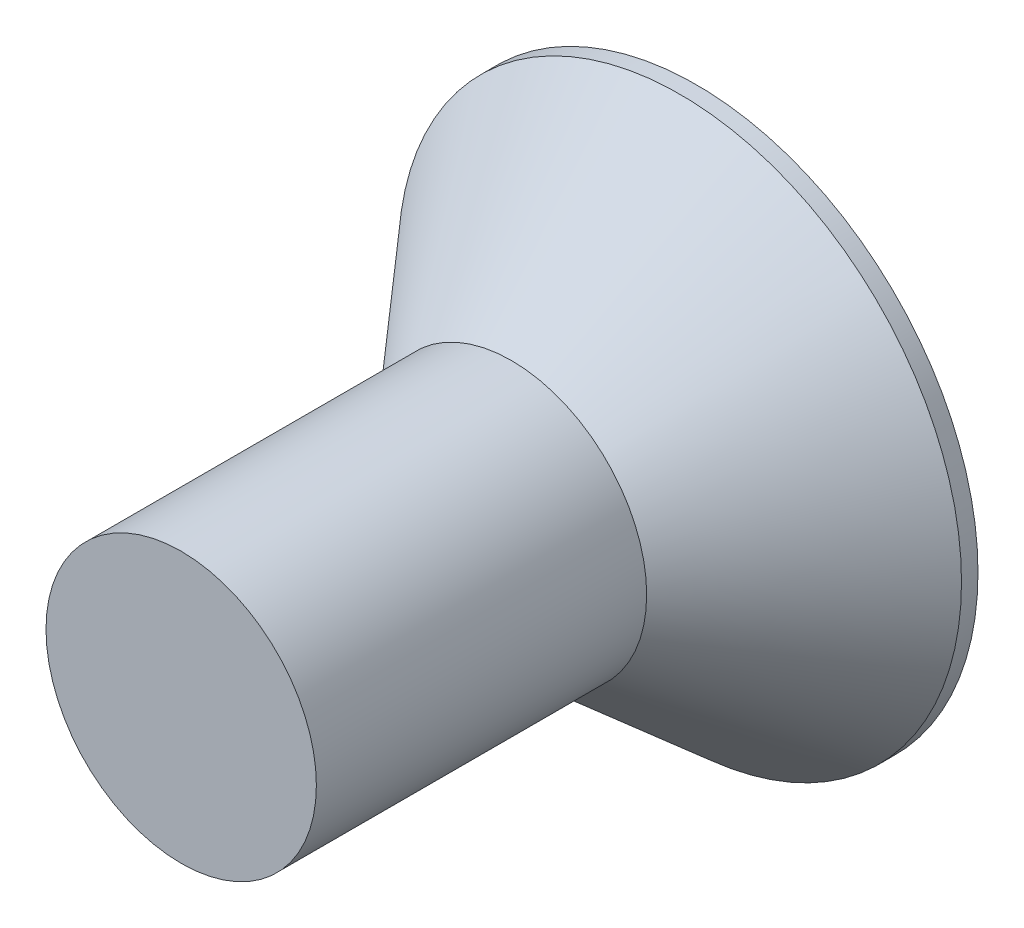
from build123d import *

# Parameters (mm, degrees)
HEX_2_DEPTH = 2.794


with BuildPart() as part:
    # Sketch6 → Revolve1 (revolve)
    with BuildSketch(Plane(origin=(0, 0, 0), x_dir=(0, 0, -1), z_dir=(1, 0, 0)), mode=Mode.PRIVATE) as revolve1_sk:
        Polygon((-7.9375, 0), (-7.9375, -2.0828), (-2.84888736, -2.0828), (-0.254, -4.338501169), (0, -4.338501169), (0, 0), align=None)
    revolve(revolve1_sk.sketch.rotate(Axis((0, 0, 7.9375), (0, 0, -1)), 270), axis=Axis((0, 0, 7.9375), (0, 0, -1)))

    # Sketch7 → HEX 2 (cut)
    with BuildSketch(Plane(origin=(0, 0, 0), x_dir=(-1, 0, 0), z_dir=(0, 0, -1))):
        Polygon((-1.1811, 0.681908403), (-1.1811, -0.681908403), (0, -1.363816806), (1.1811, -0.681908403), (1.1811, 0.681908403), (0, 1.363816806), align=None)
    extrude(amount=-HEX_2_DEPTH, mode=Mode.SUBTRACT)


solid = part.part
